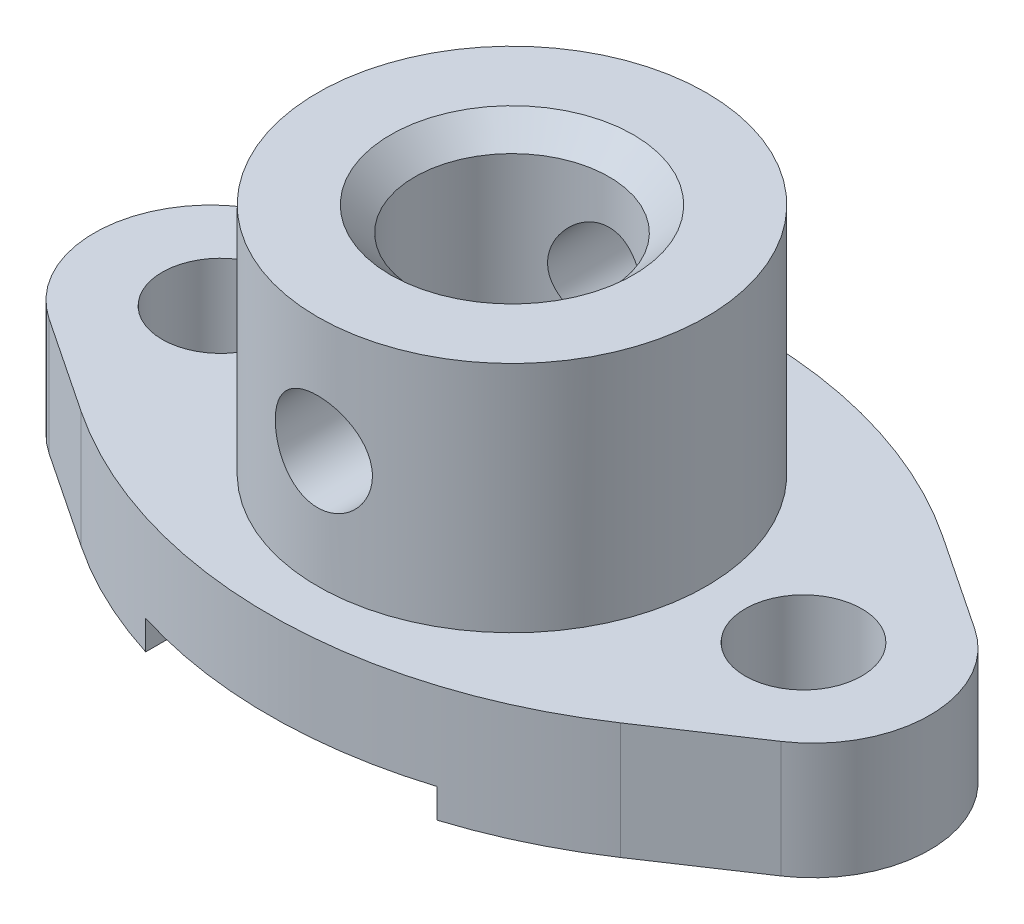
from build123d import *

# Parameters (mm, degrees)
SKETCH_1_R               = 24
EXTRUDE_1_DEPTH          = 48
CUT_EXTRUDE_1_DEPTH      = 205.665580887
CUT_EXTRUDE_1_DEPTH_BACK = 205.665580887
SKETCH_2_W               = 120
SKETCH_2_H               = 35.0995671
SKETCH_3_R               = 80
EXTRUDE_2_DEPTH          = 96
SKETCH_4_R               = 40
CUT_EXTRUDE_2_DEPTH      = 246.601302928
CHAMFER_1_SIZE           = 10
CUT_EXTRUDE_3_DEPTH      = 246.601302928
CUT_EXTRUDE_3_DEPTH_BACK = 246.601302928
SKETCH_5_R               = 20


with BuildPart() as part:
    # Sketch 1 → Extrude 1 (new body)
    with BuildSketch(Plane(origin=(0, 0, 0), x_dir=(1, 0, 0), z_dir=(0, 1, 0))):
        with BuildLine():
            Line((-110.982423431, 66.381794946), (-150.635781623, 39.931630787))
            ThreePointArc((-150.635781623, 39.931630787), (-172, 0), (-150.635781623, -39.931630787))
            Line((-150.635781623, -39.931630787), (-110.982423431, -66.381794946))
            ThreePointArc((-110.982423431, -66.381794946), (0, -100), (110.982423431, -66.381794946))
            Line((110.982423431, -66.381794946), (150.635781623, -39.931630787))
            ThreePointArc((150.635781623, -39.931630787), (172, 0), (150.635781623, 39.931630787))
            Line((150.635781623, 39.931630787), (110.982423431, 66.381794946))
            ThreePointArc((110.982423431, 66.381794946), (0, 100), (-110.982423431, 66.381794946))
        make_face()
        with Locations(Location((120, 0, 0), (0, 0, 270))):
            Circle(SKETCH_1_R, mode=Mode.SUBTRACT)
        with Locations(Location((-120, 0, 0), (0, 0, 270))):
            Circle(SKETCH_1_R, mode=Mode.SUBTRACT)
    extrude(amount=EXTRUDE_1_DEPTH)

    # Sketch 2 → Cut-Extrude 1 (cut, two sides: drawn at the far end of the back side and taken through both)
    with BuildSketch(Plane.XY.offset(-CUT_EXTRUDE_1_DEPTH_BACK)):
        with Locations((0, -5.54978355)):
            Rectangle(SKETCH_2_W, SKETCH_2_H)
    extrude(amount=CUT_EXTRUDE_1_DEPTH + CUT_EXTRUDE_1_DEPTH_BACK, mode=Mode.SUBTRACT)

    # Sketch 3 → Extrude 2 (add)
    with BuildSketch(Plane(origin=(0, 48, 0), x_dir=(1, 0, 0), z_dir=(0, 1, 0))):
        with Locations(Location((0, 0, 0), (0, 0, 90))):
            Circle(SKETCH_3_R)
    extrude(amount=EXTRUDE_2_DEPTH)

    # Sketch 4 → Cut-Extrude 2 (cut, through all)
    with BuildSketch(Plane(origin=(0, 144, 0), x_dir=(1, 0, 0), z_dir=(0, 1, 0))):
        with Locations(Location((0, 0, 0), (0, 0, 270))):
            Circle(SKETCH_4_R)
    extrude(amount=-CUT_EXTRUDE_2_DEPTH, mode=Mode.SUBTRACT)

    # Chamfer 1
    chamfer_1_edges = [part.edges().sort_by_distance(p)[0] for p in [
        (0, 144, -40),
    ]]
    chamfer(chamfer_1_edges, length=CHAMFER_1_SIZE)

    # Sketch 5 → Cut-Extrude 3 (cut, two sides: drawn at the far end of the back side and taken through both)
    with BuildSketch(Plane.XY.offset(-CUT_EXTRUDE_3_DEPTH_BACK)):
        with Locations((0, 96)):
            Circle(SKETCH_5_R)
    extrude(amount=CUT_EXTRUDE_3_DEPTH + CUT_EXTRUDE_3_DEPTH_BACK, mode=Mode.SUBTRACT)


solid = part.part
